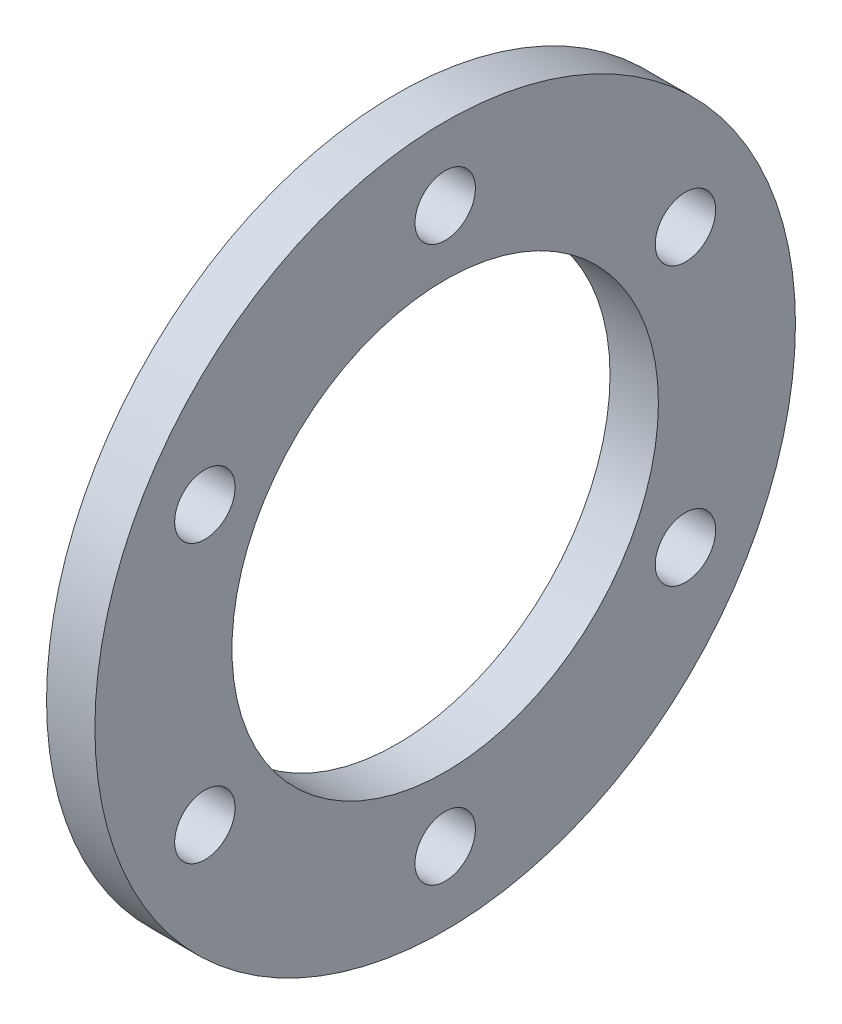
from build123d import *

# Parameters (mm, degrees)
SKETCH1_R           = 46
SKETCH1_R_2         = 28
BOSS_EXTRUDE1_DEPTH = 6.35
SKETCH2_R           = 3.96875
CUT_EXTRUDE1_DEPTH  = 66.363005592
CIRPATTERN1_COUNT   = 6


with BuildPart() as part:
    # Sketch1 → Boss-Extrude1 (new body)
    with BuildSketch(Plane(origin=(0, 0, 0), x_dir=(0, 0, -1), z_dir=(1, 0, 0))):
        Circle(SKETCH1_R)
        Circle(SKETCH1_R_2, mode=Mode.SUBTRACT)
    extrude(amount=BOSS_EXTRUDE1_DEPTH)

    # Sketch2 → Cut-Extrude1 (cut, through all)
    with BuildSketch(Plane(origin=(6.35, 0, 0), x_dir=(0, 0, -1), z_dir=(1, 0, 0))):
        with Locations((0, 36.4353125)):
            Circle(SKETCH2_R)
    cut_extrude1 = extrude(amount=-CUT_EXTRUDE1_DEPTH, mode=Mode.SUBTRACT)

    # CirPattern1: Cut-Extrude1 ×6 about axis
    cirpattern1_axis = Axis((0, 0, 0), (1, 0, 0))
    for i in range(1, CIRPATTERN1_COUNT):
        add(cut_extrude1.rotate(cirpattern1_axis, i * 360 / CIRPATTERN1_COUNT), mode=Mode.SUBTRACT)


solid = part.part
